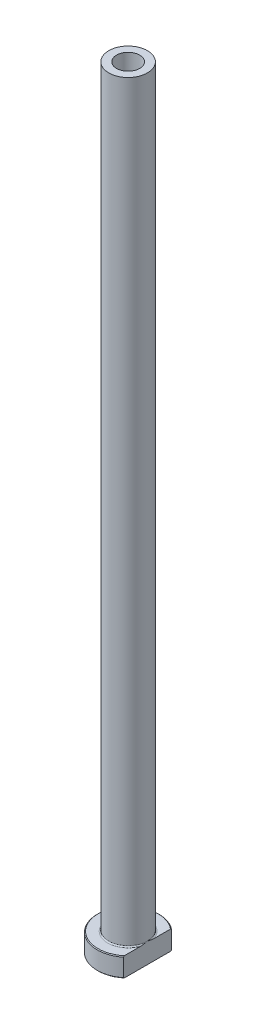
ISO-10303-21;
HEADER;
FILE_DESCRIPTION(('STEP AP214'),'2;1');
FILE_NAME('part.step','',(''),(''),'','','');
FILE_SCHEMA(('AUTOMOTIVE_DESIGN { 1 0 10303 214 1 1 1 1 }'));
ENDSEC;
DATA;
#1=APPLICATION_CONTEXT('core data for automotive mechanical design processes');
#2=APPLICATION_PROTOCOL_DEFINITION('international standard','automotive_design',2000,#1);
#3=PRODUCT_CONTEXT('',#1,'mechanical');
#4=PRODUCT('Part','Part','',(#3));
#5=PRODUCT_RELATED_PRODUCT_CATEGORY('part','',(#4));
#6=PRODUCT_DEFINITION_FORMATION('','',#4);
#7=PRODUCT_DEFINITION_CONTEXT('part definition',#1,'design');
#8=PRODUCT_DEFINITION('design','',#6,#7);
#9=PRODUCT_DEFINITION_SHAPE('','',#8);
#10=(LENGTH_UNIT() NAMED_UNIT(*) SI_UNIT(.MILLI.,.METRE.));
#11=(NAMED_UNIT(*) PLANE_ANGLE_UNIT() SI_UNIT($,.RADIAN.));
#12=(NAMED_UNIT(*) SI_UNIT($,.STERADIAN.) SOLID_ANGLE_UNIT());
#13=UNCERTAINTY_MEASURE_WITH_UNIT(LENGTH_MEASURE(1.E-05),#10,'distance_accuracy_value','');
#14=(GEOMETRIC_REPRESENTATION_CONTEXT(3) GLOBAL_UNCERTAINTY_ASSIGNED_CONTEXT((#13)) GLOBAL_UNIT_ASSIGNED_CONTEXT((#10,
#11,#12)) REPRESENTATION_CONTEXT('',''));
#15=CARTESIAN_POINT('',(0.,0.,0.));
#16=DIRECTION('',(0.,0.,1.));
#17=DIRECTION('',(1.,0.,0.));
#18=AXIS2_PLACEMENT_3D('',#15,#16,#17);
#19=CARTESIAN_POINT('',(0.,92.1876809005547,0.));
#20=DIRECTION('',(0.,1.,0.));
#21=DIRECTION('',(0.,0.,1.));
#22=AXIS2_PLACEMENT_3D('',#19,#20,#21);
#23=CYLINDRICAL_SURFACE('',#22,3.);
#24=CARTESIAN_POINT('',(0.,200.,0.));
#25=DIRECTION('',(0.,1.,0.));
#26=DIRECTION('',(0.,0.,1.));
#27=AXIS2_PLACEMENT_3D('',#24,#25,#26);
#28=CIRCLE('',#27,3.);
#29=CARTESIAN_POINT('',(0.,200.,3.));
#30=VERTEX_POINT('',#29);
#31=EDGE_CURVE('E167',#30,#30,#28,.T.);
#32=ORIENTED_EDGE('',*,*,#31,.T.);
#33=EDGE_LOOP('',(#32));
#34=FACE_BOUND('',#33,.T.);
#35=CARTESIAN_POINT('',(0.,155.,0.));
#36=DIRECTION('',(0.,1.,0.));
#37=DIRECTION('',(0.,0.,1.));
#38=AXIS2_PLACEMENT_3D('',#35,#36,#37);
#39=CIRCLE('',#38,3.);
#40=CARTESIAN_POINT('',(0.,155.,3.));
#41=VERTEX_POINT('',#40);
#42=EDGE_CURVE('E170',#41,#41,#39,.T.);
#43=ORIENTED_EDGE('',*,*,#42,.F.);
#44=EDGE_LOOP('',(#43));
#45=FACE_BOUND('',#44,.T.);
#46=ADVANCED_FACE('F32',(#34,#45),#23,.F.);
#47=CARTESIAN_POINT('',(-3.,200.,0.));
#48=DIRECTION('',(0.,1.,0.));
#49=DIRECTION('',(0.,0.,1.));
#50=AXIS2_PLACEMENT_3D('',#47,#48,#49);
#51=PLANE('',#50);
#52=CARTESIAN_POINT('',(0.,200.,0.));
#53=DIRECTION('',(0.,1.,0.));
#54=DIRECTION('',(0.,0.,1.));
#55=AXIS2_PLACEMENT_3D('',#52,#53,#54);
#56=CIRCLE('',#55,5.00000000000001);
#57=CARTESIAN_POINT('',(0.,200.,5.00000000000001));
#58=VERTEX_POINT('',#57);
#59=EDGE_CURVE('E174',#58,#58,#56,.T.);
#60=ORIENTED_EDGE('',*,*,#59,.T.);
#61=EDGE_LOOP('',(#60));
#62=FACE_BOUND('',#61,.T.);
#63=ORIENTED_EDGE('',*,*,#31,.F.);
#64=EDGE_LOOP('',(#63));
#65=FACE_BOUND('',#64,.T.);
#66=ADVANCED_FACE('F157',(#62,#65),#51,.T.);
#67=CARTESIAN_POINT('',(0.,92.1876809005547,0.));
#68=DIRECTION('',(0.,1.,0.));
#69=DIRECTION('',(0.,0.,1.));
#70=AXIS2_PLACEMENT_3D('',#67,#68,#69);
#71=CYLINDRICAL_SURFACE('',#70,5.);
#72=CARTESIAN_POINT('',(0.,5.3,0.));
#73=DIRECTION('',(0.,1.,0.));
#74=DIRECTION('',(0.,0.,1.));
#75=AXIS2_PLACEMENT_3D('',#72,#73,#74);
#76=CIRCLE('',#75,5.);
#77=CARTESIAN_POINT('',(5.,5.3,0.));
#78=VERTEX_POINT('',#77);
#79=EDGE_CURVE('E180',#78,#78,#76,.T.);
#80=ORIENTED_EDGE('',*,*,#79,.T.);
#81=EDGE_LOOP('',(#80));
#82=FACE_BOUND('',#81,.T.);
#83=ORIENTED_EDGE('',*,*,#59,.F.);
#84=EDGE_LOOP('',(#83));
#85=FACE_BOUND('',#84,.T.);
#86=ADVANCED_FACE('F162',(#82,#85),#71,.T.);
#87=CARTESIAN_POINT('',(-4.99999999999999,5.,0.));
#88=DIRECTION('',(0.,1.,0.));
#89=DIRECTION('',(0.,0.,1.));
#90=AXIS2_PLACEMENT_3D('',#87,#88,#89);
#91=PLANE('',#90);
#92=DIRECTION('',(0.,0.,1.));
#93=VECTOR('',#92,1.);
#94=CARTESIAN_POINT('',(5.,5.,0.));
#95=LINE('',#94,#93);
#96=CARTESIAN_POINT('',(5.,5.,-5.98665181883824));
#97=VERTEX_POINT('',#96);
#98=CARTESIAN_POINT('',(5.,5.,-1.75783958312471));
#99=VERTEX_POINT('',#98);
#100=EDGE_CURVE('E54',#97,#99,#95,.T.);
#101=ORIENTED_EDGE('',*,*,#100,.F.);
#102=CARTESIAN_POINT('',(0.,5.,0.));
#103=DIRECTION('',(0.,1.,0.));
#104=DIRECTION('',(0.,0.,1.));
#105=AXIS2_PLACEMENT_3D('',#102,#103,#104);
#106=CIRCLE('',#105,7.79999999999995);
#107=CARTESIAN_POINT('',(4.99999999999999,5.,5.98665181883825));
#108=VERTEX_POINT('',#107);
#109=EDGE_CURVE('E186',#97,#108,#106,.T.);
#110=ORIENTED_EDGE('',*,*,#109,.T.);
#111=CARTESIAN_POINT('',(5.,5.,1.75783958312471));
#112=VERTEX_POINT('',#111);
#113=EDGE_CURVE('E134',#112,#108,#95,.T.);
#114=ORIENTED_EDGE('',*,*,#113,.F.);
#115=CARTESIAN_POINT('',(0.,5.,0.));
#116=DIRECTION('',(0.,1.,0.));
#117=DIRECTION('',(0.,0.,1.));
#118=AXIS2_PLACEMENT_3D('',#115,#116,#117);
#119=CIRCLE('',#118,5.3);
#120=EDGE_CURVE('E183',#112,#99,#119,.F.);
#121=ORIENTED_EDGE('',*,*,#120,.T.);
#122=EDGE_LOOP('',(#101,#110,#114,#121));
#123=FACE_BOUND('',#122,.T.);
#124=ADVANCED_FACE('F197',(#123),#91,.T.);
#125=CARTESIAN_POINT('',(0.,92.1876809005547,0.));
#126=DIRECTION('',(0.,1.,0.));
#127=DIRECTION('',(0.,0.,1.));
#128=AXIS2_PLACEMENT_3D('',#125,#126,#127);
#129=CYLINDRICAL_SURFACE('',#128,7.99999999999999);
#130=DIRECTION('',(0.,-1.,0.));
#131=VECTOR('',#130,1.);
#132=CARTESIAN_POINT('',(4.99999999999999,200.,6.24499799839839));
#133=LINE('',#132,#131);
#134=CARTESIAN_POINT('',(4.99999999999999,4.79999999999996,6.24499799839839));
#135=VERTEX_POINT('',#134);
#136=CARTESIAN_POINT('',(4.99999999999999,0.200000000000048,6.24499799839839));
#137=VERTEX_POINT('',#136);
#138=EDGE_CURVE('E82',#135,#137,#133,.T.);
#139=ORIENTED_EDGE('',*,*,#138,.F.);
#140=CARTESIAN_POINT('',(0.,4.79999999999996,0.));
#141=DIRECTION('',(0.,1.,0.));
#142=DIRECTION('',(0.,0.,1.));
#143=AXIS2_PLACEMENT_3D('',#140,#141,#142);
#144=CIRCLE('',#143,7.99999999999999);
#145=CARTESIAN_POINT('',(5.,4.79999999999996,-6.24499799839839));
#146=VERTEX_POINT('',#145);
#147=EDGE_CURVE('E95',#135,#146,#144,.F.);
#148=ORIENTED_EDGE('',*,*,#147,.T.);
#149=DIRECTION('',(0.,-1.,0.));
#150=VECTOR('',#149,1.);
#151=CARTESIAN_POINT('',(5.,200.,-6.24499799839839));
#152=LINE('',#151,#150);
#153=CARTESIAN_POINT('',(5.,0.200000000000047,-6.24499799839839));
#154=VERTEX_POINT('',#153);
#155=EDGE_CURVE('E192',#146,#154,#152,.T.);
#156=ORIENTED_EDGE('',*,*,#155,.T.);
#157=CARTESIAN_POINT('',(0.,0.200000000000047,0.));
#158=DIRECTION('',(0.,-1.,0.));
#159=DIRECTION('',(0.,0.,-1.));
#160=AXIS2_PLACEMENT_3D('',#157,#158,#159);
#161=CIRCLE('',#160,7.99999999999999);
#162=EDGE_CURVE('E98',#154,#137,#161,.F.);
#163=ORIENTED_EDGE('',*,*,#162,.T.);
#164=EDGE_LOOP('',(#139,#148,#156,#163));
#165=FACE_BOUND('',#164,.T.);
#166=ADVANCED_FACE('F190',(#165),#129,.T.);
#167=CARTESIAN_POINT('',(-7.99999999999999,0.,0.));
#168=DIRECTION('',(0.,-1.,0.));
#169=DIRECTION('',(0.,0.,-1.));
#170=AXIS2_PLACEMENT_3D('',#167,#168,#169);
#171=PLANE('',#170);
#172=CARTESIAN_POINT('',(0.,0.,0.));
#173=DIRECTION('',(0.,-1.,0.));
#174=DIRECTION('',(0.,0.,-1.));
#175=AXIS2_PLACEMENT_3D('',#172,#173,#174);
#176=CIRCLE('',#175,3.74999999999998);
#177=CARTESIAN_POINT('',(0.,0.,-3.74999999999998));
#178=VERTEX_POINT('',#177);
#179=EDGE_CURVE('E40',#178,#178,#176,.F.);
#180=ORIENTED_EDGE('',*,*,#179,.T.);
#181=EDGE_LOOP('',(#180));
#182=FACE_BOUND('',#181,.T.);
#183=DIRECTION('',(0.,0.,-1.));
#184=VECTOR('',#183,1.);
#185=CARTESIAN_POINT('',(4.99999999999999,0.,6.24499799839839));
#186=LINE('',#185,#184);
#187=CARTESIAN_POINT('',(4.99999999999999,0.,5.98665181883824));
#188=VERTEX_POINT('',#187);
#189=CARTESIAN_POINT('',(5.,0.,-5.98665181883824));
#190=VERTEX_POINT('',#189);
#191=EDGE_CURVE('E47',#188,#190,#186,.T.);
#192=ORIENTED_EDGE('',*,*,#191,.F.);
#193=CARTESIAN_POINT('',(0.,0.,0.));
#194=DIRECTION('',(0.,-1.,0.));
#195=DIRECTION('',(0.,0.,-1.));
#196=AXIS2_PLACEMENT_3D('',#193,#194,#195);
#197=CIRCLE('',#196,7.79999999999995);
#198=EDGE_CURVE('E92',#188,#190,#197,.T.);
#199=ORIENTED_EDGE('',*,*,#198,.T.);
#200=EDGE_LOOP('',(#192,#199));
#201=FACE_BOUND('',#200,.T.);
#202=ADVANCED_FACE('F91',(#182,#201),#171,.T.);
#203=CARTESIAN_POINT('',(0.,92.1876809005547,0.));
#204=DIRECTION('',(0.,1.,0.));
#205=DIRECTION('',(0.,0.,1.));
#206=AXIS2_PLACEMENT_3D('',#203,#204,#205);
#207=CYLINDRICAL_SURFACE('',#206,3.25);
#208=CARTESIAN_POINT('',(0.,0.499999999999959,0.));
#209=DIRECTION('',(0.,-1.,0.));
#210=DIRECTION('',(0.,0.,-1.));
#211=AXIS2_PLACEMENT_3D('',#208,#209,#210);
#212=CIRCLE('',#211,3.25);
#213=CARTESIAN_POINT('',(0.,0.499999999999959,-3.25));
#214=VERTEX_POINT('',#213);
#215=EDGE_CURVE('E11',#214,#214,#212,.T.);
#216=ORIENTED_EDGE('',*,*,#215,.T.);
#217=EDGE_LOOP('',(#216));
#218=FACE_BOUND('',#217,.T.);
#219=CARTESIAN_POINT('',(0.,143.,0.));
#220=DIRECTION('',(0.,1.,0.));
#221=DIRECTION('',(0.,0.,1.));
#222=AXIS2_PLACEMENT_3D('',#219,#220,#221);
#223=CIRCLE('',#222,3.25000000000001);
#224=CARTESIAN_POINT('',(0.,143.,3.25000000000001));
#225=VERTEX_POINT('',#224);
#226=EDGE_CURVE('E172',#225,#225,#223,.T.);
#227=ORIENTED_EDGE('',*,*,#226,.T.);
#228=EDGE_LOOP('',(#227));
#229=FACE_BOUND('',#228,.T.);
#230=ADVANCED_FACE('F215',(#218,#229),#207,.F.);
#231=CARTESIAN_POINT('',(0.,143.,0.));
#232=DIRECTION('',(0.,-1.,0.));
#233=DIRECTION('',(0.,0.,-1.));
#234=AXIS2_PLACEMENT_3D('',#231,#232,#233);
#235=CONICAL_SURFACE('',#234,3.25000000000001,0.0208303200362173);
#236=ORIENTED_EDGE('',*,*,#42,.T.);
#237=EDGE_LOOP('',(#236));
#238=FACE_BOUND('',#237,.T.);
#239=ORIENTED_EDGE('',*,*,#226,.F.);
#240=EDGE_LOOP('',(#239));
#241=FACE_BOUND('',#240,.T.);
#242=ADVANCED_FACE('F111',(#238,#241),#235,.F.);
#243=CARTESIAN_POINT('',(0.,5.3,0.));
#244=DIRECTION('',(0.,1.,0.));
#245=DIRECTION('',(0.,0.,1.));
#246=AXIS2_PLACEMENT_3D('',#243,#244,#245);
#247=TOROIDAL_SURFACE('',#246,5.3,0.3);
#248=ORIENTED_EDGE('',*,*,#120,.F.);
#249=CARTESIAN_POINT('',(5.,5.3,0.));
#250=CARTESIAN_POINT('',(5.,5.30000062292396,-1.3146965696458E-10));
#251=CARTESIAN_POINT('',(5.,5.30000124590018,2.52759314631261E-07));
#252=CARTESIAN_POINT('',(5.,5.30000240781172,9.47164542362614E-07));
#253=CARTESIAN_POINT('',(5.,5.30000293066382,1.40594060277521E-06));
#254=CARTESIAN_POINT('',(5.,5.30000402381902,2.5063763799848E-06));
#255=CARTESIAN_POINT('',(5.,5.30000457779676,3.16588946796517E-06));
#256=CARTESIAN_POINT('',(5.,5.3000055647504,4.52860008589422E-06));
#257=CARTESIAN_POINT('',(5.,5.30000600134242,5.22939487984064E-06));
#258=CARTESIAN_POINT('',(5.,5.3000076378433,7.96122052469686E-06));
#259=CARTESIAN_POINT('',(5.,5.3000087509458,1.00477418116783E-05));
#260=CARTESIAN_POINT('',(5.,5.30001056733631,1.41660883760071E-05));
#261=CARTESIAN_POINT('',(5.,5.30001129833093,1.61861792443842E-05));
#262=CARTESIAN_POINT('',(5.,5.30001439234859,2.47865755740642E-05));
#263=CARTESIAN_POINT('',(5.,5.30001672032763,3.13830303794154E-05));
#264=CARTESIAN_POINT('',(5.,5.30002012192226,4.38084243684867E-05));
#265=CARTESIAN_POINT('',(5.,5.30002133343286,4.95992759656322E-05));
#266=CARTESIAN_POINT('',(5.,5.30003020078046,9.27862645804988E-05));
#267=CARTESIAN_POINT('',(5.,5.30003696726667,0.000130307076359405));
#268=CARTESIAN_POINT('',(4.99999999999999,5.30006659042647,0.000278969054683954));
#269=CARTESIAN_POINT('',(4.99999999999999,5.30009481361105,0.00038902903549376));
#270=CARTESIAN_POINT('',(5.,5.30020506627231,0.000826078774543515));
#271=CARTESIAN_POINT('',(5.,5.30028365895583,0.0011536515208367));
#272=CARTESIAN_POINT('',(4.99999999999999,5.30059919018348,0.00245925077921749));
#273=CARTESIAN_POINT('',(4.99999999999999,5.30084048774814,0.0034365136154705));
#274=CARTESIAN_POINT('',(5.,5.30184626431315,0.00752058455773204));
#275=CARTESIAN_POINT('',(5.,5.30260525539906,0.0106283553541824));
#276=CARTESIAN_POINT('',(4.99999999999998,5.30996461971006,0.040748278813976));
#277=CARTESIAN_POINT('',(4.99999999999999,5.31658985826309,0.0677561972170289));
#278=CARTESIAN_POINT('',(5.,5.32953319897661,0.120688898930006));
#279=CARTESIAN_POINT('',(5.,5.33585289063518,0.146613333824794));
#280=CARTESIAN_POINT('',(4.99999999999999,5.3492605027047,0.201795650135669));
#281=CARTESIAN_POINT('',(5.,5.35634306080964,0.231054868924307));
#282=CARTESIAN_POINT('',(5.,5.37050252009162,0.289917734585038));
#283=CARTESIAN_POINT('',(5.,5.37757848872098,0.319521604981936));
#284=CARTESIAN_POINT('',(5.,5.39452602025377,0.391032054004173));
#285=CARTESIAN_POINT('',(5.,5.40434071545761,0.432952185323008));
#286=CARTESIAN_POINT('',(5.,5.4234014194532,0.515763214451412));
#287=CARTESIAN_POINT('',(5.,5.43265559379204,0.55665223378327));
#288=CARTESIAN_POINT('',(5.,5.45710553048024,0.667075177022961));
#289=CARTESIAN_POINT('',(5.,5.47194176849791,0.736689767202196));
#290=CARTESIAN_POINT('',(5.,5.50018229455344,0.876836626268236));
#291=CARTESIAN_POINT('',(5.,5.5135731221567,0.947371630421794));
#292=CARTESIAN_POINT('',(5.,5.53930921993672,1.0949732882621));
#293=CARTESIAN_POINT('',(5.,5.55146217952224,1.17207432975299));
#294=CARTESIAN_POINT('',(5.,5.57239669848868,1.32672649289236));
#295=CARTESIAN_POINT('',(5.,5.58117877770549,1.40427754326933));
#296=CARTESIAN_POINT('',(5.,5.59499725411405,1.56873827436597));
#297=CARTESIAN_POINT('',(5.,5.59948802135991,1.65570044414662));
#298=CARTESIAN_POINT('',(5.,5.60018885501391,1.78535304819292));
#299=CARTESIAN_POINT('',(5.,5.5994521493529,1.82802575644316));
#300=CARTESIAN_POINT('',(5.,5.59559364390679,1.91325081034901));
#301=CARTESIAN_POINT('',(5.,5.59247319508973,1.95580321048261));
#302=CARTESIAN_POINT('',(5.,5.58383242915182,2.03512365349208));
#303=CARTESIAN_POINT('',(5.,5.57867386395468,2.07192937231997));
#304=CARTESIAN_POINT('',(5.,5.56543793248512,2.14526756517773));
#305=CARTESIAN_POINT('',(5.,5.55734203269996,2.18179676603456));
#306=CARTESIAN_POINT('',(5.,5.53718005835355,2.25427226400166));
#307=CARTESIAN_POINT('',(5.,5.52507057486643,2.29020746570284));
#308=CARTESIAN_POINT('',(5.,5.50270928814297,2.34223029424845));
#309=CARTESIAN_POINT('',(5.,5.49457811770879,2.3592231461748));
#310=CARTESIAN_POINT('',(5.,5.47657809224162,2.39224900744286));
#311=CARTESIAN_POINT('',(5.,5.46671281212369,2.40828390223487));
#312=CARTESIAN_POINT('',(5.,5.4469589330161,2.43579467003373));
#313=CARTESIAN_POINT('',(5.,5.43745879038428,2.44754592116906));
#314=CARTESIAN_POINT('',(5.,5.41677914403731,2.46946476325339));
#315=CARTESIAN_POINT('',(5.,5.40560543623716,2.47963758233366));
#316=CARTESIAN_POINT('',(5.,5.38617750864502,2.49393642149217));
#317=CARTESIAN_POINT('',(5.,5.37851643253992,2.49886271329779));
#318=CARTESIAN_POINT('',(5.,5.36252740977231,2.50749953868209));
#319=CARTESIAN_POINT('',(5.,5.35419984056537,2.51121075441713));
#320=CARTESIAN_POINT('',(5.,5.33690648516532,2.51712941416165));
#321=CARTESIAN_POINT('',(5.,5.32793451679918,2.51931927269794));
#322=CARTESIAN_POINT('',(5.,5.30973576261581,2.52185978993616));
#323=CARTESIAN_POINT('',(5.,5.30050931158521,2.52221275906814));
#324=CARTESIAN_POINT('',(5.,5.28349166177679,2.5211245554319));
#325=CARTESIAN_POINT('',(5.,5.27568322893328,2.51993178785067));
#326=CARTESIAN_POINT('',(5.,5.26036860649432,2.51628294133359));
#327=CARTESIAN_POINT('',(5.,5.2528626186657,2.51382603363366));
#328=CARTESIAN_POINT('',(5.,5.23590266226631,2.50685484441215));
#329=CARTESIAN_POINT('',(5.,5.22661875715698,2.50192984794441));
#330=CARTESIAN_POINT('',(5.,5.20895514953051,2.49066548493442));
#331=CARTESIAN_POINT('',(5.,5.20057756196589,2.48432291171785));
#332=CARTESIAN_POINT('',(5.,5.17987008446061,2.46645212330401));
#333=CARTESIAN_POINT('',(5.,5.16824151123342,2.45411867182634));
#334=CARTESIAN_POINT('',(5.,5.14692461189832,2.42790849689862));
#335=CARTESIAN_POINT('',(5.,5.13723987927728,2.41402898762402));
#336=CARTESIAN_POINT('',(5.,5.11080706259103,2.37143175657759));
#337=CARTESIAN_POINT('',(5.,5.09628770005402,2.34134703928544));
#338=CARTESIAN_POINT('',(5.,5.07130349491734,2.27940731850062));
#339=CARTESIAN_POINT('',(5.,5.06087110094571,2.24754035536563));
#340=CARTESIAN_POINT('',(5.,5.03890359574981,2.16787245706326));
#341=CARTESIAN_POINT('',(5.,5.02913523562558,2.11959065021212));
#342=CARTESIAN_POINT('',(5.,5.01416953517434,2.02224928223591));
#343=CARTESIAN_POINT('',(5.,5.00898637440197,1.97318778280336));
#344=CARTESIAN_POINT('',(5.,5.00220823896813,1.87635767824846));
#345=CARTESIAN_POINT('',(5.,5.00050709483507,1.82859609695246));
#346=CARTESIAN_POINT('',(5.,4.99969104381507,1.73330165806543));
#347=CARTESIAN_POINT('',(5.,5.00056327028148,1.68576884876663));
#348=CARTESIAN_POINT('',(5.,5.0048429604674,1.57937770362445));
#349=CARTESIAN_POINT('',(5.,5.00880932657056,1.52054285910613));
#350=CARTESIAN_POINT('',(5.,5.01925964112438,1.40312974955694));
#351=CARTESIAN_POINT('',(5.,5.02574264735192,1.34455139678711));
#352=CARTESIAN_POINT('',(5.,5.04090087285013,1.22627662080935));
#353=CARTESIAN_POINT('',(5.,5.0496242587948,1.16658647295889));
#354=CARTESIAN_POINT('',(5.,5.06877923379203,1.04732463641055));
#355=CARTESIAN_POINT('',(5.,5.07921523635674,0.987753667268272));
#356=CARTESIAN_POINT('',(5.,5.10551698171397,0.8469361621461));
#357=CARTESIAN_POINT('',(5.,5.12196565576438,0.765799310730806));
#358=CARTESIAN_POINT('',(5.,5.15639716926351,0.604819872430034));
#359=CARTESIAN_POINT('',(5.,5.17436050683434,0.524973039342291));
#360=CARTESIAN_POINT('',(4.99999999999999,5.20921667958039,0.374726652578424));
#361=CARTESIAN_POINT('',(4.99999999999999,5.22599388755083,0.304300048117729));
#362=CARTESIAN_POINT('',(5.,5.25191105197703,0.196907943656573));
#363=CARTESIAN_POINT('',(5.,5.26090146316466,0.159905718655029));
#364=CARTESIAN_POINT('',(4.99999999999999,5.27881854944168,0.0865164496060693));
#365=CARTESIAN_POINT('',(4.99999999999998,5.28774391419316,0.0501291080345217));
#366=CARTESIAN_POINT('',(5.,5.29739627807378,0.0106218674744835));
#367=CARTESIAN_POINT('',(5.,5.2981568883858,0.00750762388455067));
#368=CARTESIAN_POINT('',(4.99999999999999,5.2991630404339,0.00342209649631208));
#369=CARTESIAN_POINT('',(4.99999999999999,5.29940309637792,0.00244985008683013));
#370=CARTESIAN_POINT('',(5.,5.29971711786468,0.00115049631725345));
#371=CARTESIAN_POINT('',(5.,5.29979541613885,0.000824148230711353));
#372=CARTESIAN_POINT('',(4.99999999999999,5.29990531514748,0.000388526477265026));
#373=CARTESIAN_POINT('',(4.99999999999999,5.29993348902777,0.000278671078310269));
#374=CARTESIAN_POINT('',(5.,5.29996306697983,0.000130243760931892));
#375=CARTESIAN_POINT('',(5.,5.29996982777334,9.27511411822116E-05));
#376=CARTESIAN_POINT('',(5.,5.29997868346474,4.95929910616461E-05));
#377=CARTESIAN_POINT('',(5.,5.29997989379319,4.38036579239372E-05));
#378=CARTESIAN_POINT('',(5.,5.29998329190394,3.13814206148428E-05));
#379=CARTESIAN_POINT('',(5.,5.29998561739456,2.47865234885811E-05));
#380=CARTESIAN_POINT('',(5.,5.29998870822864,1.6187755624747E-05));
#381=CARTESIAN_POINT('',(5.,5.2999894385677,1.41677779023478E-05));
#382=CARTESIAN_POINT('',(5.,5.29999125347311,1.00495539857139E-05));
#383=CARTESIAN_POINT('',(5.,5.29999236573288,7.96302729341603E-06));
#384=CARTESIAN_POINT('',(5.,5.29999400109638,5.23107460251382E-06));
#385=CARTESIAN_POINT('',(5.,5.29999443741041,4.53021079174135E-06));
#386=CARTESIAN_POINT('',(5.,5.29999542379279,3.16731195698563E-06));
#387=CARTESIAN_POINT('',(5.,5.2999959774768,2.507677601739E-06));
#388=CARTESIAN_POINT('',(5.,5.2999970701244,1.40695902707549E-06));
#389=CARTESIAN_POINT('',(5.,5.29999759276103,9.48032654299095E-07));
#390=CARTESIAN_POINT('',(5.,5.29999875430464,2.53244426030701E-07));
#391=CARTESIAN_POINT('',(5.,5.2999993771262,1.31460458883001E-10));
#392=CARTESIAN_POINT('',(5.,5.3,0.));
#393=B_SPLINE_CURVE_WITH_KNOTS('',3,(#249,#250,#251,#252,#253,#254,#255,#256,#257,#258,#259,
#260,#261,#262,#263,#264,#265,#266,#267,#268,#269,#270,#271,#272,#273,#274,#275,#276,#277,#278,
#279,#280,#281,#282,#283,#284,#285,#286,#287,#288,#289,#290,#291,#292,#293,#294,#295,#296,#297,
#298,#299,#300,#301,#302,#303,#304,#305,#306,#307,#308,#309,#310,#311,#312,#313,#314,#315,#316,
#317,#318,#319,#320,#321,#322,#323,#324,#325,#326,#327,#328,#329,#330,#331,#332,#333,#334,#335,
#336,#337,#338,#339,#340,#341,#342,#343,#344,#345,#346,#347,#348,#349,#350,#351,#352,#353,#354,
#355,#356,#357,#358,#359,#360,#361,#362,#363,#364,#365,#366,#367,#368,#369,#370,#371,#372,#373,
#374,#375,#376,#377,#378,#379,#380,#381,#382,#383,#384,#385,#386,#387,#388,#389,#390,#391,#392),
.UNSPECIFIED.,.T.,.F.,(4,2,2,2,2,2,2,2,2,2,2,2,2,2,2,2,2,2,2,2,2,2,2,2,2,2,2,2,2,2,2,2,2,2,2,2,
2,2,2,2,2,2,2,2,2,2,2,2,2,2,2,2,2,2,2,2,2,2,2,2,2,2,2,2,2,2,2,2,2,2,2,4),(0.,
1.88939190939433E-06,3.9805869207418E-06,6.54818279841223E-06,9.02404031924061E-06,
1.6093870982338E-05,2.2532814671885E-05,4.3484387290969E-05,6.12120135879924E-05,
0.000175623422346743,0.000516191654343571,0.00152710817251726,0.00454656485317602,
0.0141443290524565,0.0975679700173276,0.177619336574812,0.267931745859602,0.359245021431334,
0.48840519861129,0.614173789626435,0.827694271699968,1.04305715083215,1.27715608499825,
1.51121890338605,1.77214751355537,1.90013509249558,2.02805018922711,2.13945459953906,
2.25157451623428,2.36494894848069,2.42139235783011,2.4777207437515,2.52293802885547,
2.56800219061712,2.59524342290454,2.62246933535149,2.65000494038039,2.67750590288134,
2.70108948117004,2.72468854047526,2.7560397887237,2.78746268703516,2.83802806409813,
2.88868607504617,2.98834295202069,3.08877575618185,3.23618650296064,3.38405153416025,
3.52733651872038,3.66990630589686,3.84673903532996,4.02350562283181,4.20444776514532,
4.38586374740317,4.6341955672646,4.8797127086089,5.09690175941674,5.21113882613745,
5.32353360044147,5.33315137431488,5.33615533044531,5.33716246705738,5.33750240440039,
5.33761672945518,5.3376344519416,5.33765539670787,5.33766183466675,5.3376689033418,
5.33767137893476,5.33767394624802,5.33767603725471,5.33767792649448),.UNSPECIFIED.);
#394=EDGE_CURVE('E126',#112,#78,#393,.T.);
#395=ORIENTED_EDGE('',*,*,#394,.T.);
#396=ORIENTED_EDGE('',*,*,#79,.F.);
#397=CARTESIAN_POINT('',(5.,5.3,0.));
#398=CARTESIAN_POINT('',(5.,5.29999937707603,1.31470987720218E-10));
#399=CARTESIAN_POINT('',(5.,5.29999875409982,-2.527593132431E-07));
#400=CARTESIAN_POINT('',(5.,5.29999759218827,-9.47164540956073E-07));
#401=CARTESIAN_POINT('',(5.,5.29999706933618,-1.40594060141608E-06));
#402=CARTESIAN_POINT('',(5.,5.29999597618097,-2.50637637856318E-06));
#403=CARTESIAN_POINT('',(5.,5.29999542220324,-3.16588946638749E-06));
#404=CARTESIAN_POINT('',(5.,5.29999443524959,-4.52860008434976E-06));
#405=CARTESIAN_POINT('',(5.,5.29999399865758,-5.22939487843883E-06));
#406=CARTESIAN_POINT('',(5.,5.2999923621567,-7.9612205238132E-06));
#407=CARTESIAN_POINT('',(5.,5.2999912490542,-1.00477418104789E-05));
#408=CARTESIAN_POINT('',(5.,5.29998943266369,-1.41660883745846E-05));
#409=CARTESIAN_POINT('',(5.,5.29998870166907,-1.6186179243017E-05));
#410=CARTESIAN_POINT('',(5.,5.29998560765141,-2.47865755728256E-05));
#411=CARTESIAN_POINT('',(5.,5.29998327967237,-3.13830303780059E-05));
#412=CARTESIAN_POINT('',(5.,5.29997987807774,-4.38084243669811E-05));
#413=CARTESIAN_POINT('',(5.,5.29997866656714,-4.95992759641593E-05));
#414=CARTESIAN_POINT('',(5.,5.29996979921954,-9.27862645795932E-05));
#415=CARTESIAN_POINT('',(5.,5.29996303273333,-0.000130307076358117));
#416=CARTESIAN_POINT('',(4.99999999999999,5.29993340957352,-0.000278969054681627));
#417=CARTESIAN_POINT('',(4.99999999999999,5.29990518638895,-0.000389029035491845));
#418=CARTESIAN_POINT('',(5.,5.29979493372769,-0.000826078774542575));
#419=CARTESIAN_POINT('',(5.,5.29971634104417,-0.00115365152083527));
#420=CARTESIAN_POINT('',(4.99999999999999,5.29940080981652,-0.00245925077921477));
#421=CARTESIAN_POINT('',(4.99999999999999,5.29915951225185,-0.00343651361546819));
#422=CARTESIAN_POINT('',(5.,5.29815373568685,-0.00752058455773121));
#423=CARTESIAN_POINT('',(5.,5.29739474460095,-0.0106283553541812));
#424=CARTESIAN_POINT('',(4.99999999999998,5.29003538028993,-0.0407482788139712));
#425=CARTESIAN_POINT('',(4.99999999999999,5.28341014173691,-0.0677561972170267));
#426=CARTESIAN_POINT('',(5.,5.27046680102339,-0.120688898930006));
#427=CARTESIAN_POINT('',(5.,5.26414710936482,-0.146613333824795));
#428=CARTESIAN_POINT('',(4.99999999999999,5.2507394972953,-0.201795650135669));
#429=CARTESIAN_POINT('',(5.,5.24365693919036,-0.231054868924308));
#430=CARTESIAN_POINT('',(5.,5.22949747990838,-0.289917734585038));
#431=CARTESIAN_POINT('',(5.,5.22242151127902,-0.319521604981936));
#432=CARTESIAN_POINT('',(5.,5.20547397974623,-0.391032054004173));
#433=CARTESIAN_POINT('',(5.,5.19565928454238,-0.432952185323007));
#434=CARTESIAN_POINT('',(5.,5.1765985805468,-0.51576321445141));
#435=CARTESIAN_POINT('',(5.,5.16734440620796,-0.556652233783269));
#436=CARTESIAN_POINT('',(5.,5.14289446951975,-0.667075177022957));
#437=CARTESIAN_POINT('',(5.,5.12805823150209,-0.736689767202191));
#438=CARTESIAN_POINT('',(5.,5.09981770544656,-0.876836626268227));
#439=CARTESIAN_POINT('',(5.,5.0864268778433,-0.947371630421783));
#440=CARTESIAN_POINT('',(5.,5.06069078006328,-1.09497328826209));
#441=CARTESIAN_POINT('',(5.,5.04853782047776,-1.17207432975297));
#442=CARTESIAN_POINT('',(5.,5.02760330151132,-1.32672649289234));
#443=CARTESIAN_POINT('',(5.,5.01882122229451,-1.40427754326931));
#444=CARTESIAN_POINT('',(5.,5.00500274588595,-1.56873827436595));
#445=CARTESIAN_POINT('',(5.,5.00051197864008,-1.65570044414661));
#446=CARTESIAN_POINT('',(5.,4.99981114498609,-1.78535304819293));
#447=CARTESIAN_POINT('',(5.,5.0005478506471,-1.82802575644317));
#448=CARTESIAN_POINT('',(5.,5.00440635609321,-1.91325081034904));
#449=CARTESIAN_POINT('',(5.,5.00752680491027,-1.95580321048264));
#450=CARTESIAN_POINT('',(5.,5.01616757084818,-2.0351236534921));
#451=CARTESIAN_POINT('',(5.,5.02132613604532,-2.07192937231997));
#452=CARTESIAN_POINT('',(5.,5.03456206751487,-2.1452675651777));
#453=CARTESIAN_POINT('',(5.,5.04265796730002,-2.18179676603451));
#454=CARTESIAN_POINT('',(5.,5.06281994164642,-2.25427226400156));
#455=CARTESIAN_POINT('',(5.,5.07492942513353,-2.29020746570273));
#456=CARTESIAN_POINT('',(5.,5.09729071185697,-2.34223029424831));
#457=CARTESIAN_POINT('',(5.,5.10542188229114,-2.35922314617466));
#458=CARTESIAN_POINT('',(5.,5.12342190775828,-2.3922490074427));
#459=CARTESIAN_POINT('',(5.,5.1332871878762,-2.40828390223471));
#460=CARTESIAN_POINT('',(5.,5.15304106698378,-2.43579467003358));
#461=CARTESIAN_POINT('',(5.,5.1625412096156,-2.44754592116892));
#462=CARTESIAN_POINT('',(5.,5.18322085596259,-2.46946476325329));
#463=CARTESIAN_POINT('',(5.,5.19439456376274,-2.47963758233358));
#464=CARTESIAN_POINT('',(5.,5.21382249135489,-2.49393642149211));
#465=CARTESIAN_POINT('',(5.,5.22148356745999,-2.49886271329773));
#466=CARTESIAN_POINT('',(5.,5.2374725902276,-2.50749953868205));
#467=CARTESIAN_POINT('',(5.,5.24580015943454,-2.51121075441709));
#468=CARTESIAN_POINT('',(5.,5.2630935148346,-2.51712941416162));
#469=CARTESIAN_POINT('',(5.,5.27206548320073,-2.51931927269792));
#470=CARTESIAN_POINT('',(5.,5.29026423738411,-2.52185978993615));
#471=CARTESIAN_POINT('',(5.,5.29949068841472,-2.52221275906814));
#472=CARTESIAN_POINT('',(5.,5.31650833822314,-2.5211245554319));
#473=CARTESIAN_POINT('',(5.,5.32431677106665,-2.51993178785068));
#474=CARTESIAN_POINT('',(5.,5.33963139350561,-2.51628294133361));
#475=CARTESIAN_POINT('',(5.,5.34713738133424,-2.51382603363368));
#476=CARTESIAN_POINT('',(5.,5.36409733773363,-2.50685484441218));
#477=CARTESIAN_POINT('',(5.,5.37338124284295,-2.50192984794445));
#478=CARTESIAN_POINT('',(5.,5.39104485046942,-2.49066548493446));
#479=CARTESIAN_POINT('',(5.,5.39942243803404,-2.4843229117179));
#480=CARTESIAN_POINT('',(5.,5.42012991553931,-2.46645212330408));
#481=CARTESIAN_POINT('',(5.,5.4317584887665,-2.45411867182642));
#482=CARTESIAN_POINT('',(5.,5.4530753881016,-2.42790849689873));
#483=CARTESIAN_POINT('',(5.,5.46276012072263,-2.41402898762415));
#484=CARTESIAN_POINT('',(5.,5.48919293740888,-2.37143175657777));
#485=CARTESIAN_POINT('',(5.,5.50371229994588,-2.34134703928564));
#486=CARTESIAN_POINT('',(5.,5.52869650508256,-2.2794073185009));
#487=CARTESIAN_POINT('',(5.,5.53912889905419,-2.24754035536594));
#488=CARTESIAN_POINT('',(5.,5.56109640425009,-2.16787245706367));
#489=CARTESIAN_POINT('',(5.,5.57086476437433,-2.11959065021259));
#490=CARTESIAN_POINT('',(5.,5.58583046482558,-2.0222492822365));
#491=CARTESIAN_POINT('',(5.,5.59101362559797,-1.97318778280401));
#492=CARTESIAN_POINT('',(5.,5.59779176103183,-1.87635767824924));
#493=CARTESIAN_POINT('',(5.,5.59949290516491,-1.82859609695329));
#494=CARTESIAN_POINT('',(5.,5.60030895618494,-1.73330165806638));
#495=CARTESIAN_POINT('',(5.,5.59943672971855,-1.68576884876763));
#496=CARTESIAN_POINT('',(5.,5.59515703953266,-1.57937770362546));
#497=CARTESIAN_POINT('',(5.,5.59119067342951,-1.52054285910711));
#498=CARTESIAN_POINT('',(5.,5.58074035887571,-1.40312974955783));
#499=CARTESIAN_POINT('',(5.,5.57425735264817,-1.34455139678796));
#500=CARTESIAN_POINT('',(5.,5.55909912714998,-1.22627662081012));
#501=CARTESIAN_POINT('',(5.,5.55037574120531,-1.16658647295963));
#502=CARTESIAN_POINT('',(5.,5.53122076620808,-1.0473246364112));
#503=CARTESIAN_POINT('',(5.,5.52078476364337,-0.987753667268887));
#504=CARTESIAN_POINT('',(5.,5.49448301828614,-0.846936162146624));
#505=CARTESIAN_POINT('',(5.,5.47803434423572,-0.765799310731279));
#506=CARTESIAN_POINT('',(5.,5.44360283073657,-0.604819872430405));
#507=CARTESIAN_POINT('',(5.,5.42563949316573,-0.524973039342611));
#508=CARTESIAN_POINT('',(4.99999999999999,5.39078332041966,-0.37472665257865));
#509=CARTESIAN_POINT('',(4.99999999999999,5.37400611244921,-0.304300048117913));
#510=CARTESIAN_POINT('',(5.,5.34808894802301,-0.196907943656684));
#511=CARTESIAN_POINT('',(5.,5.33909853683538,-0.159905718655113));
#512=CARTESIAN_POINT('',(4.99999999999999,5.32118145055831,-0.0865164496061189));
#513=CARTESIAN_POINT('',(4.99999999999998,5.31225608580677,-0.0501291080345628));
#514=CARTESIAN_POINT('',(5.,5.30260372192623,-0.0106218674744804));
#515=CARTESIAN_POINT('',(5.,5.30184311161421,-0.00750762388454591));
#516=CARTESIAN_POINT('',(4.99999999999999,5.30083695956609,-0.00342209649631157));
#517=CARTESIAN_POINT('',(4.99999999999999,5.30059690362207,-0.00244985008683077));
#518=CARTESIAN_POINT('',(5.,5.30028288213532,-0.00115049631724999));
#519=CARTESIAN_POINT('',(5.,5.30020458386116,-0.000824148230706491));
#520=CARTESIAN_POINT('',(4.99999999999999,5.30009468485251,-0.000388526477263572));
#521=CARTESIAN_POINT('',(4.99999999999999,5.30006651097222,-0.000278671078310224));
#522=CARTESIAN_POINT('',(5.,5.30003693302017,-0.000130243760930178));
#523=CARTESIAN_POINT('',(5.,5.30003017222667,-9.27511411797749E-05));
#524=CARTESIAN_POINT('',(5.,5.30002131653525,-4.95929910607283E-05));
#525=CARTESIAN_POINT('',(5.,5.30002010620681,-4.38036579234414E-05));
#526=CARTESIAN_POINT('',(5.,5.30001670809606,-3.13814206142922E-05));
#527=CARTESIAN_POINT('',(5.,5.30001438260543,-2.47865234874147E-05));
#528=CARTESIAN_POINT('',(5.,5.30001129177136,-1.61877556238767E-05));
#529=CARTESIAN_POINT('',(5.,5.3000105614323,-1.41677779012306E-05));
#530=CARTESIAN_POINT('',(5.,5.30000874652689,-1.00495539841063E-05));
#531=CARTESIAN_POINT('',(5.,5.30000763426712,-7.96302729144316E-06));
#532=CARTESIAN_POINT('',(5.,5.30000599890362,-5.23107460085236E-06));
#533=CARTESIAN_POINT('',(5.,5.30000556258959,-4.53021079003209E-06));
#534=CARTESIAN_POINT('',(5.,5.3000045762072,-3.16731195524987E-06));
#535=CARTESIAN_POINT('',(5.,5.3000040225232,-2.50767759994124E-06));
#536=CARTESIAN_POINT('',(5.,5.3000029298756,-1.40695902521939E-06));
#537=CARTESIAN_POINT('',(5.,5.30000240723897,-9.48032652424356E-07));
#538=CARTESIAN_POINT('',(5.,5.30000124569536,-2.53244424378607E-07));
#539=CARTESIAN_POINT('',(5.,5.3000006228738,-1.31459011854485E-10));
#540=CARTESIAN_POINT('',(5.,5.3,0.));
#541=B_SPLINE_CURVE_WITH_KNOTS('',3,(#397,#398,#399,#400,#401,#402,#403,#404,#405,#406,#407,
#408,#409,#410,#411,#412,#413,#414,#415,#416,#417,#418,#419,#420,#421,#422,#423,#424,#425,#426,
#427,#428,#429,#430,#431,#432,#433,#434,#435,#436,#437,#438,#439,#440,#441,#442,#443,#444,#445,
#446,#447,#448,#449,#450,#451,#452,#453,#454,#455,#456,#457,#458,#459,#460,#461,#462,#463,#464,
#465,#466,#467,#468,#469,#470,#471,#472,#473,#474,#475,#476,#477,#478,#479,#480,#481,#482,#483,
#484,#485,#486,#487,#488,#489,#490,#491,#492,#493,#494,#495,#496,#497,#498,#499,#500,#501,#502,
#503,#504,#505,#506,#507,#508,#509,#510,#511,#512,#513,#514,#515,#516,#517,#518,#519,#520,#521,
#522,#523,#524,#525,#526,#527,#528,#529,#530,#531,#532,#533,#534,#535,#536,#537,#538,#539,#540),
.UNSPECIFIED.,.T.,.F.,(4,2,2,2,2,2,2,2,2,2,2,2,2,2,2,2,2,2,2,2,2,2,2,2,2,2,2,2,2,2,2,2,2,2,2,2,
2,2,2,2,2,2,2,2,2,2,2,2,2,2,2,2,2,2,2,2,2,2,2,2,2,2,2,2,2,2,2,2,2,2,2,4),(0.,
1.88939190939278E-06,3.9805869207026E-06,6.54818279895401E-06,9.02404031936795E-06,
1.60938709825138E-05,2.25328146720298E-05,4.34843872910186E-05,6.12120135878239E-05,
0.000175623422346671,0.000516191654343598,0.00152710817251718,0.00454656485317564,
0.0141443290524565,0.0975679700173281,0.177619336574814,0.267931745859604,0.359245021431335,
0.488405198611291,0.614173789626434,0.827694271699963,1.04305715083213,1.27715608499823,
1.51121890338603,1.77214751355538,1.90013509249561,2.02805018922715,2.13945459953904,
2.2515745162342,2.36494894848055,2.42139235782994,2.4777207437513,2.52293802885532,
2.56800219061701,2.59524342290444,2.6224693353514,2.65000494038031,2.67750590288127,
2.70108948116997,2.7246885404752,2.75603978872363,2.78746268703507,2.83802806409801,
2.888686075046,2.98834295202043,3.08877575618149,3.2361865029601,3.38405153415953,
3.52733651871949,3.6699063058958,3.84673903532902,4.02350562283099,4.20444776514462,
4.38586374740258,4.63419556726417,4.87971270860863,5.0969017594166,5.21113882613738,
5.32353360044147,5.33315137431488,5.33615533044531,5.33716246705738,5.33750240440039,
5.33761672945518,5.3376344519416,5.33765539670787,5.33766183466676,5.3376689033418,
5.33767137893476,5.33767394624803,5.33767603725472,5.33767792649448),.UNSPECIFIED.);
#542=EDGE_CURVE('E135',#78,#99,#541,.T.);
#543=ORIENTED_EDGE('',*,*,#542,.T.);
#544=EDGE_LOOP('',(#248,#395,#396,#543));
#545=FACE_BOUND('',#544,.T.);
#546=ADVANCED_FACE('F141',(#545),#247,.F.);
#547=CARTESIAN_POINT('',(0.,5.,0.));
#548=DIRECTION('',(0.,-1.,0.));
#549=DIRECTION('',(0.,0.,-1.));
#550=AXIS2_PLACEMENT_3D('',#547,#548,#549);
#551=CONICAL_SURFACE('',#550,7.79999999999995,0.78539816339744);
#552=CARTESIAN_POINT('',(5.,-1.82162423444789,-13.7401563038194));
#553=CARTESIAN_POINT('',(5.,-1.61889813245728,-13.5244204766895));
#554=CARTESIAN_POINT('',(5.,-1.41646387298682,-13.3084101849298));
#555=CARTESIAN_POINT('',(5.,-1.01227657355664,-12.8757508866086));
#556=CARTESIAN_POINT('',(5.,-0.810523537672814,-12.6591018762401));
#557=CARTESIAN_POINT('',(5.,-0.206157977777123,-12.0077661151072));
#558=CARTESIAN_POINT('',(5.,0.19528061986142,-11.5719884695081));
#559=CARTESIAN_POINT('',(5.,1.00388282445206,-10.6856136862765));
#560=CARTESIAN_POINT('',(5.,1.41093902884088,-10.2349182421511));
#561=CARTESIAN_POINT('',(5.,2.01658324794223,-9.55471676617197));
#562=CARTESIAN_POINT('',(5.,2.2175823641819,-9.32735800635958));
#563=CARTESIAN_POINT('',(5.,2.61761142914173,-8.87091599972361));
#564=CARTESIAN_POINT('',(5.,2.81664139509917,-8.64183276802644));
#565=CARTESIAN_POINT('',(5.,3.21217345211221,-8.18170099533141));
#566=CARTESIAN_POINT('',(5.,3.40867681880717,-7.95065355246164));
#567=CARTESIAN_POINT('',(5.,3.79865427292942,-7.4859998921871));
#568=CARTESIAN_POINT('',(5.,3.99212827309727,-7.25239360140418));
#569=CARTESIAN_POINT('',(5.,4.37558160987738,-6.78155890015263));
#570=CARTESIAN_POINT('',(5.,4.56555334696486,-6.54432428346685));
#571=CARTESIAN_POINT('',(5.,4.94042138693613,-6.06589574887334));
#572=CARTESIAN_POINT('',(5.,5.12531810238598,-5.82470215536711));
#573=CARTESIAN_POINT('',(5.,5.48653546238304,-5.33972956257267));
#574=CARTESIAN_POINT('',(5.,5.66292392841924,-5.09600137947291));
#575=CARTESIAN_POINT('',(5.,6.00675382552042,-4.60213647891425));
#576=CARTESIAN_POINT('',(5.,6.17419169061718,-4.35199726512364));
#577=CARTESIAN_POINT('',(5.,6.49592993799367,-3.84445040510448));
#578=CARTESIAN_POINT('',(5.,6.65027272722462,-3.58707012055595));
#579=CARTESIAN_POINT('',(5.,6.86813414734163,-3.19356592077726));
#580=CARTESIAN_POINT('',(5.,6.93845533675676,-3.06120993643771));
#581=CARTESIAN_POINT('',(5.,7.07360441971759,-2.79373319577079));
#582=CARTESIAN_POINT('',(5.,7.1384331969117,-2.65861288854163));
#583=CARTESIAN_POINT('',(5.,7.26869642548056,-2.3693638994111));
#584=CARTESIAN_POINT('',(5.,7.33331212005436,-2.21486278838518));
#585=CARTESIAN_POINT('',(5.,7.45243473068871,-1.90194073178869));
#586=CARTESIAN_POINT('',(5.,7.50694001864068,-1.74351915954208));
#587=CARTESIAN_POINT('',(5.,7.60343746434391,-1.42384276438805));
#588=CARTESIAN_POINT('',(5.,7.64549910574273,-1.26260921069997));
#589=CARTESIAN_POINT('',(5.,7.71543089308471,-0.93706224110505));
#590=CARTESIAN_POINT('',(5.,7.74330266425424,-0.772749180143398));
#591=CARTESIAN_POINT('',(5.,7.78344284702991,-0.439876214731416));
#592=CARTESIAN_POINT('',(5.,7.79548961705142,-0.271289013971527));
#593=CARTESIAN_POINT('',(5.,7.80240809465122,0.0662275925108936));
#594=CARTESIAN_POINT('',(5.,7.79728142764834,0.235156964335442));
#595=CARTESIAN_POINT('',(5.,7.77017954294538,0.572209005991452));
#596=CARTESIAN_POINT('',(5.,7.74814735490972,0.740327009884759));
#597=CARTESIAN_POINT('',(5.,7.68863212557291,1.0737984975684));
#598=CARTESIAN_POINT('',(5.,7.65114437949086,1.23915112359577));
#599=CARTESIAN_POINT('',(5.,7.54734433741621,1.62344926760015));
#600=CARTESIAN_POINT('',(5.,7.4755358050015,1.84089917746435));
#601=CARTESIAN_POINT('',(5.,7.31300119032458,2.26856946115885));
#602=CARTESIAN_POINT('',(5.,7.2222646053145,2.47878574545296));
#603=CARTESIAN_POINT('',(5.,7.07492970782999,2.79014067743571));
#604=CARTESIAN_POINT('',(5.,7.02362278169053,2.89384077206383));
#605=CARTESIAN_POINT('',(5.,6.91783840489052,3.0996162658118));
#606=CARTESIAN_POINT('',(4.99999999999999,6.86336091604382,3.20169164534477));
#607=CARTESIAN_POINT('',(4.99999999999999,6.75169048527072,3.40428995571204));
#608=CARTESIAN_POINT('',(4.99999999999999,6.69449856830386,3.50481345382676));
#609=CARTESIAN_POINT('',(4.99999999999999,6.5777419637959,3.7044620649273));
#610=CARTESIAN_POINT('',(4.99999999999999,6.51817739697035,3.80358724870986));
#611=CARTESIAN_POINT('',(4.99999999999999,6.30853654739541,4.14435766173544));
#612=CARTESIAN_POINT('',(4.99999999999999,6.15326588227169,4.38281352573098));
#613=CARTESIAN_POINT('',(4.99999999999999,5.83377190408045,4.85367607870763));
#614=CARTESIAN_POINT('',(4.99999999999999,5.66954595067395,5.08608095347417));
#615=CARTESIAN_POINT('',(4.99999999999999,5.33431698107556,5.54628554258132));
#616=CARTESIAN_POINT('',(4.99999999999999,5.16330740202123,5.77408045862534));
#617=CARTESIAN_POINT('',(4.99999999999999,4.81629923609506,6.22578157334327));
#618=CARTESIAN_POINT('',(4.99999999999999,4.6403011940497,6.44968819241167));
#619=CARTESIAN_POINT('',(4.99999999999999,4.28368615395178,6.89532578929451));
#620=CARTESIAN_POINT('',(4.99999999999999,4.10305289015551,7.11704371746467));
#621=CARTESIAN_POINT('',(4.99999999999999,3.73870710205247,7.55793799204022));
#622=CARTESIAN_POINT('',(4.99999999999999,3.55499450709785,7.77711427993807));
#623=CARTESIAN_POINT('',(4.99999999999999,3.18521083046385,8.21325328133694));
#624=CARTESIAN_POINT('',(4.99999999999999,2.99914113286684,8.43021717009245));
#625=CARTESIAN_POINT('',(4.99999999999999,2.62499812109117,8.86241167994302));
#626=CARTESIAN_POINT('',(4.99999999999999,2.43692478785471,9.07764228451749));
#627=CARTESIAN_POINT('',(4.99999999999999,1.91463404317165,9.67075518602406));
#628=CARTESIAN_POINT('',(4.99999999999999,1.57868086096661,10.0471086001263));
#629=CARTESIAN_POINT('',(4.99999999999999,0.903003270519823,10.7965122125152));
#630=CARTESIAN_POINT('',(4.99999999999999,0.563278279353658,11.169561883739));
#631=CARTESIAN_POINT('',(4.99999999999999,-0.11614994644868,11.9100168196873));
#632=CARTESIAN_POINT('',(4.99999999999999,-0.455830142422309,12.2774432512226));
#633=CARTESIAN_POINT('',(4.99999999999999,-1.1372864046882,13.0102135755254));
#634=CARTESIAN_POINT('',(4.99999999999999,-1.47906204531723,13.3755578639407));
#635=CARTESIAN_POINT('',(4.99999999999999,-1.82162423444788,13.7401563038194));
#636=B_SPLINE_CURVE_WITH_KNOTS('',3,(#552,#553,#554,#555,#556,#557,#558,#559,#560,#561,#562,
#563,#564,#565,#566,#567,#568,#569,#570,#571,#572,#573,#574,#575,#576,#577,#578,#579,#580,#581,
#582,#583,#584,#585,#586,#587,#588,#589,#590,#591,#592,#593,#594,#595,#596,#597,#598,#599,#600,
#601,#602,#603,#604,#605,#606,#607,#608,#609,#610,#611,#612,#613,#614,#615,#616,#617,#618,#619,
#620,#621,#622,#623,#624,#625,#626,#627,#628,#629,#630,#631,#632,#633,#634,#635),.UNSPECIFIED.,
.F.,.F.,(4,2,2,2,2,2,2,2,2,2,2,2,2,2,2,2,2,2,2,2,2,2,2,2,2,2,2,2,2,2,2,2,2,2,2,2,2,2,2,2,2,4),
(0.,0.888120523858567,1.77624635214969,3.55372511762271,5.3755948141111,6.28598924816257,
7.19637570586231,8.10628289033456,9.01621623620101,9.92793449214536,10.8395784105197,
11.7420025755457,12.6447836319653,13.5445196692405,13.9940505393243,14.4435089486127,
14.9456212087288,15.4478142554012,15.9471477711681,16.4464240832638,16.952621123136,
17.458770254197,17.9666326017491,18.4746496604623,19.160451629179,19.8466351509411,
20.193687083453,20.5407431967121,20.8876692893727,21.2345777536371,22.087909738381,
22.9414946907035,23.7959266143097,24.6502655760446,25.5081848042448,26.3661237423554,
27.2235803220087,28.0810450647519,29.5944656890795,31.1081235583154,32.60926785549,
34.1101167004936),.UNSPECIFIED.);
#637=EDGE_CURVE('E133',#146,#97,#636,.T.);
#638=ORIENTED_EDGE('',*,*,#637,.F.);
#639=ORIENTED_EDGE('',*,*,#147,.F.);
#640=EDGE_CURVE('E118',#108,#135,#636,.T.);
#641=ORIENTED_EDGE('',*,*,#640,.F.);
#642=ORIENTED_EDGE('',*,*,#109,.F.);
#643=EDGE_LOOP('',(#638,#639,#641,#642));
#644=FACE_BOUND('',#643,.T.);
#645=ADVANCED_FACE('F145',(#644),#551,.T.);
#646=CARTESIAN_POINT('',(0.,0.200000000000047,0.));
#647=DIRECTION('',(0.,1.,0.));
#648=DIRECTION('',(0.,0.,1.));
#649=AXIS2_PLACEMENT_3D('',#646,#647,#648);
#650=CONICAL_SURFACE('',#649,7.99999999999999,0.78539816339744);
#651=CARTESIAN_POINT('',(4.99999999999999,6.82162423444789,13.7401563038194));
#652=CARTESIAN_POINT('',(4.99999999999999,6.61889813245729,13.5244204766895));
#653=CARTESIAN_POINT('',(4.99999999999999,6.41646387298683,13.3084101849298));
#654=CARTESIAN_POINT('',(4.99999999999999,6.01227657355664,12.8757508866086));
#655=CARTESIAN_POINT('',(4.99999999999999,5.81052353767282,12.6591018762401));
#656=CARTESIAN_POINT('',(4.99999999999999,5.20615797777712,12.0077661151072));
#657=CARTESIAN_POINT('',(4.99999999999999,4.80471938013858,11.5719884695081));
#658=CARTESIAN_POINT('',(4.99999999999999,3.99611717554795,10.6856136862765));
#659=CARTESIAN_POINT('',(4.99999999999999,3.58906097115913,10.2349182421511));
#660=CARTESIAN_POINT('',(4.99999999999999,2.98341675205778,9.55471676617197));
#661=CARTESIAN_POINT('',(4.99999999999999,2.78241763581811,9.32735800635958));
#662=CARTESIAN_POINT('',(4.99999999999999,2.38238857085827,8.87091599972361));
#663=CARTESIAN_POINT('',(4.99999999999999,2.18335860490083,8.64183276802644));
#664=CARTESIAN_POINT('',(4.99999999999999,1.78782654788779,8.18170099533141));
#665=CARTESIAN_POINT('',(4.99999999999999,1.59132318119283,7.95065355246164));
#666=CARTESIAN_POINT('',(4.99999999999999,1.20134572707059,7.4859998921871));
#667=CARTESIAN_POINT('',(4.99999999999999,1.00787172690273,7.25239360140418));
#668=CARTESIAN_POINT('',(4.99999999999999,0.624418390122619,6.78155890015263));
#669=CARTESIAN_POINT('',(4.99999999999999,0.434446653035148,6.54432428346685));
#670=CARTESIAN_POINT('',(4.99999999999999,0.0595786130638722,6.06589574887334));
#671=CARTESIAN_POINT('',(4.99999999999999,-0.125318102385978,5.82470215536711));
#672=CARTESIAN_POINT('',(4.99999999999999,-0.486535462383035,5.33972956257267));
#673=CARTESIAN_POINT('',(4.99999999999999,-0.662923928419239,5.09600137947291));
#674=CARTESIAN_POINT('',(4.99999999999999,-1.00675382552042,4.60213647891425));
#675=CARTESIAN_POINT('',(4.99999999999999,-1.17419169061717,4.35199726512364));
#676=CARTESIAN_POINT('',(4.99999999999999,-1.49592993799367,3.84445040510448));
#677=CARTESIAN_POINT('',(4.99999999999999,-1.65027272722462,3.58707012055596));
#678=CARTESIAN_POINT('',(4.99999999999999,-1.86813414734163,3.19356592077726));
#679=CARTESIAN_POINT('',(5.,-1.93845533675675,3.06120993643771));
#680=CARTESIAN_POINT('',(5.,-2.07360441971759,2.79373319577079));
#681=CARTESIAN_POINT('',(5.,-2.13843319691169,2.65861288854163));
#682=CARTESIAN_POINT('',(5.,-2.26869642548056,2.3693638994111));
#683=CARTESIAN_POINT('',(5.,-2.33331212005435,2.21486278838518));
#684=CARTESIAN_POINT('',(5.,-2.4524347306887,1.9019407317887));
#685=CARTESIAN_POINT('',(5.,-2.50694001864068,1.74351915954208));
#686=CARTESIAN_POINT('',(5.,-2.60343746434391,1.42384276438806));
#687=CARTESIAN_POINT('',(5.,-2.64549910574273,1.26260921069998));
#688=CARTESIAN_POINT('',(5.,-2.7154308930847,0.937062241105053));
#689=CARTESIAN_POINT('',(5.,-2.74330266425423,0.772749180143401));
#690=CARTESIAN_POINT('',(5.,-2.7834428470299,0.439876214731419));
#691=CARTESIAN_POINT('',(5.,-2.79548961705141,0.27128901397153));
#692=CARTESIAN_POINT('',(5.,-2.80240809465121,-0.0662275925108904));
#693=CARTESIAN_POINT('',(5.,-2.79728142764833,-0.235156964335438));
#694=CARTESIAN_POINT('',(5.,-2.77017954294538,-0.572209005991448));
#695=CARTESIAN_POINT('',(5.,-2.74814735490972,-0.740327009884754));
#696=CARTESIAN_POINT('',(5.,-2.68863212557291,-1.0737984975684));
#697=CARTESIAN_POINT('',(5.,-2.65114437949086,-1.23915112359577));
#698=CARTESIAN_POINT('',(5.,-2.5473443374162,-1.62344926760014));
#699=CARTESIAN_POINT('',(5.,-2.47553580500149,-1.84089917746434));
#700=CARTESIAN_POINT('',(5.,-2.31300119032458,-2.26856946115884));
#701=CARTESIAN_POINT('',(5.,-2.2222646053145,-2.47878574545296));
#702=CARTESIAN_POINT('',(5.,-2.07492970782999,-2.7901406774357));
#703=CARTESIAN_POINT('',(5.,-2.02362278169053,-2.89384077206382));
#704=CARTESIAN_POINT('',(5.,-1.91783840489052,-3.0996162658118));
#705=CARTESIAN_POINT('',(5.,-1.86336091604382,-3.20169164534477));
#706=CARTESIAN_POINT('',(5.,-1.75169048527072,-3.40428995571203));
#707=CARTESIAN_POINT('',(5.,-1.69449856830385,-3.50481345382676));
#708=CARTESIAN_POINT('',(5.,-1.5777419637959,-3.70446206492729));
#709=CARTESIAN_POINT('',(5.,-1.51817739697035,-3.80358724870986));
#710=CARTESIAN_POINT('',(5.,-1.30853654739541,-4.14435766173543));
#711=CARTESIAN_POINT('',(5.,-1.15326588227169,-4.38281352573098));
#712=CARTESIAN_POINT('',(5.,-0.833771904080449,-4.85367607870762));
#713=CARTESIAN_POINT('',(5.,-0.669545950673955,-5.08608095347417));
#714=CARTESIAN_POINT('',(5.,-0.334316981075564,-5.54628554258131));
#715=CARTESIAN_POINT('',(5.,-0.163307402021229,-5.77408045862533));
#716=CARTESIAN_POINT('',(5.,0.183700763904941,-6.22578157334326));
#717=CARTESIAN_POINT('',(5.,0.359698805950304,-6.44968819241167));
#718=CARTESIAN_POINT('',(5.,0.71631384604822,-6.8953257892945));
#719=CARTESIAN_POINT('',(5.,0.896947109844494,-7.11704371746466));
#720=CARTESIAN_POINT('',(5.,1.26129289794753,-7.55793799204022));
#721=CARTESIAN_POINT('',(5.,1.44500549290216,-7.77711427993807));
#722=CARTESIAN_POINT('',(5.,1.81478916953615,-8.21325328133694));
#723=CARTESIAN_POINT('',(5.,2.00085886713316,-8.43021717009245));
#724=CARTESIAN_POINT('',(5.,2.37500187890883,-8.86241167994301));
#725=CARTESIAN_POINT('',(5.,2.56307521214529,-9.07764228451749));
#726=CARTESIAN_POINT('',(5.,3.08536595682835,-9.67075518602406));
#727=CARTESIAN_POINT('',(5.,3.4213191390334,-10.0471086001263));
#728=CARTESIAN_POINT('',(5.,4.09699672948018,-10.7965122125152));
#729=CARTESIAN_POINT('',(5.,4.43672172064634,-11.169561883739));
#730=CARTESIAN_POINT('',(5.,5.11614994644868,-11.9100168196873));
#731=CARTESIAN_POINT('',(5.,5.45583014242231,-12.2774432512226));
#732=CARTESIAN_POINT('',(5.,6.13728640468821,-13.0102135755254));
#733=CARTESIAN_POINT('',(5.,6.47906204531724,-13.3755578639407));
#734=CARTESIAN_POINT('',(5.,6.82162423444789,-13.7401563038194));
#735=B_SPLINE_CURVE_WITH_KNOTS('',3,(#651,#652,#653,#654,#655,#656,#657,#658,#659,#660,#661,
#662,#663,#664,#665,#666,#667,#668,#669,#670,#671,#672,#673,#674,#675,#676,#677,#678,#679,#680,
#681,#682,#683,#684,#685,#686,#687,#688,#689,#690,#691,#692,#693,#694,#695,#696,#697,#698,#699,
#700,#701,#702,#703,#704,#705,#706,#707,#708,#709,#710,#711,#712,#713,#714,#715,#716,#717,#718,
#719,#720,#721,#722,#723,#724,#725,#726,#727,#728,#729,#730,#731,#732,#733,#734),.UNSPECIFIED.,
.F.,.F.,(4,2,2,2,2,2,2,2,2,2,2,2,2,2,2,2,2,2,2,2,2,2,2,2,2,2,2,2,2,2,2,2,2,2,2,2,2,2,2,2,2,4),
(0.,0.888120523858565,1.77624635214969,3.55372511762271,5.3755948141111,6.28598924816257,
7.19637570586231,8.10628289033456,9.01621623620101,9.92793449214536,10.8395784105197,
11.7420025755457,12.6447836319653,13.5445196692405,13.9940505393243,14.4435089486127,
14.9456212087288,15.4478142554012,15.9471477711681,16.4464240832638,16.952621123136,
17.458770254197,17.9666326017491,18.4746496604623,19.160451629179,19.8466351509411,
20.193687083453,20.5407431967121,20.8876692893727,21.2345777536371,22.087909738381,
22.9414946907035,23.7959266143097,24.6502655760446,25.5081848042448,26.3661237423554,
27.2235803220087,28.0810450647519,29.5944656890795,31.1081235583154,32.60926785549,
34.1101167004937),.UNSPECIFIED.);
#736=EDGE_CURVE('E79',#137,#188,#735,.T.);
#737=ORIENTED_EDGE('',*,*,#736,.F.);
#738=ORIENTED_EDGE('',*,*,#162,.F.);
#739=EDGE_CURVE('E87',#190,#154,#735,.T.);
#740=ORIENTED_EDGE('',*,*,#739,.F.);
#741=ORIENTED_EDGE('',*,*,#198,.F.);
#742=EDGE_LOOP('',(#737,#738,#740,#741));
#743=FACE_BOUND('',#742,.T.);
#744=ADVANCED_FACE('F94',(#743),#650,.T.);
#745=CARTESIAN_POINT('',(4.99999999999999,200.,6.24499799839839));
#746=DIRECTION('',(-1.,0.,0.));
#747=DIRECTION('',(0.,0.,1.));
#748=AXIS2_PLACEMENT_3D('',#745,#746,#747);
#749=PLANE('',#748);
#750=ORIENTED_EDGE('',*,*,#394,.F.);
#751=ORIENTED_EDGE('',*,*,#113,.T.);
#752=ORIENTED_EDGE('',*,*,#640,.T.);
#753=ORIENTED_EDGE('',*,*,#138,.T.);
#754=ORIENTED_EDGE('',*,*,#736,.T.);
#755=ORIENTED_EDGE('',*,*,#191,.T.);
#756=ORIENTED_EDGE('',*,*,#739,.T.);
#757=ORIENTED_EDGE('',*,*,#155,.F.);
#758=ORIENTED_EDGE('',*,*,#637,.T.);
#759=ORIENTED_EDGE('',*,*,#100,.T.);
#760=ORIENTED_EDGE('',*,*,#542,.F.);
#761=EDGE_LOOP('',(#750,#751,#752,#753,#754,#755,#756,#757,#758,#759,#760));
#762=FACE_BOUND('',#761,.T.);
#763=ADVANCED_FACE('F80',(#762),#749,.F.);
#764=CARTESIAN_POINT('',(0.,0.,0.));
#765=DIRECTION('',(0.,-1.,0.));
#766=DIRECTION('',(0.,0.,-1.));
#767=AXIS2_PLACEMENT_3D('',#764,#765,#766);
#768=CONICAL_SURFACE('',#767,3.74999999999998,0.785398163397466);
#769=ORIENTED_EDGE('',*,*,#215,.F.);
#770=EDGE_LOOP('',(#769));
#771=FACE_BOUND('',#770,.T.);
#772=ORIENTED_EDGE('',*,*,#179,.F.);
#773=EDGE_LOOP('',(#772));
#774=FACE_BOUND('',#773,.T.);
#775=ADVANCED_FACE('F34',(#771,#774),#768,.F.);
#776=CLOSED_SHELL('',(#46,#66,#86,#124,#166,#202,#230,#242,#546,#645,#744,#763,#775));
#777=MANIFOLD_SOLID_BREP('B2',#776);
#778=ADVANCED_BREP_SHAPE_REPRESENTATION('',(#18,#777),#14);
#779=SHAPE_DEFINITION_REPRESENTATION(#9,#778);
ENDSEC;
END-ISO-10303-21;
